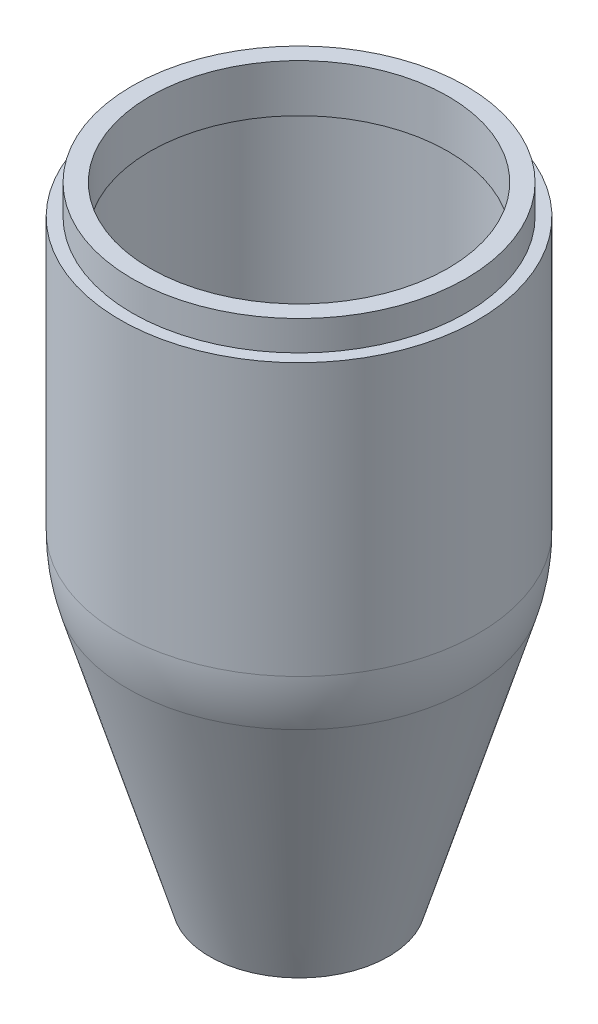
ISO-10303-21;
HEADER;
FILE_DESCRIPTION(('STEP AP214'),'2;1');
FILE_NAME('part.step','',(''),(''),'','','');
FILE_SCHEMA(('AUTOMOTIVE_DESIGN { 1 0 10303 214 1 1 1 1 }'));
ENDSEC;
DATA;
#1=APPLICATION_CONTEXT('core data for automotive mechanical design processes');
#2=APPLICATION_PROTOCOL_DEFINITION('international standard','automotive_design',2000,#1);
#3=PRODUCT_CONTEXT('',#1,'mechanical');
#4=PRODUCT('Part','Part','',(#3));
#5=PRODUCT_RELATED_PRODUCT_CATEGORY('part','',(#4));
#6=PRODUCT_DEFINITION_FORMATION('','',#4);
#7=PRODUCT_DEFINITION_CONTEXT('part definition',#1,'design');
#8=PRODUCT_DEFINITION('design','',#6,#7);
#9=PRODUCT_DEFINITION_SHAPE('','',#8);
#10=(LENGTH_UNIT() NAMED_UNIT(*) SI_UNIT(.MILLI.,.METRE.));
#11=(NAMED_UNIT(*) PLANE_ANGLE_UNIT() SI_UNIT($,.RADIAN.));
#12=(NAMED_UNIT(*) SI_UNIT($,.STERADIAN.) SOLID_ANGLE_UNIT());
#13=UNCERTAINTY_MEASURE_WITH_UNIT(LENGTH_MEASURE(1.E-05),#10,'distance_accuracy_value','');
#14=(GEOMETRIC_REPRESENTATION_CONTEXT(3) GLOBAL_UNCERTAINTY_ASSIGNED_CONTEXT((#13)) GLOBAL_UNIT_ASSIGNED_CONTEXT((#10,
#11,#12)) REPRESENTATION_CONTEXT('',''));
#15=CARTESIAN_POINT('',(0.,0.,0.));
#16=DIRECTION('',(0.,0.,1.));
#17=DIRECTION('',(1.,0.,0.));
#18=AXIS2_PLACEMENT_3D('',#15,#16,#17);
#19=CARTESIAN_POINT('',(0.,100.,0.));
#20=DIRECTION('',(0.,1.,0.));
#21=DIRECTION('',(0.,0.,1.));
#22=AXIS2_PLACEMENT_3D('',#19,#20,#21);
#23=PLANE('',#22);
#24=CARTESIAN_POINT('',(0.,100.,0.));
#25=DIRECTION('',(0.,-1.,0.));
#26=DIRECTION('',(0.,0.,-1.));
#27=AXIS2_PLACEMENT_3D('',#24,#25,#26);
#28=CIRCLE('',#27,30.);
#29=CARTESIAN_POINT('',(0.,100.,-30.));
#30=VERTEX_POINT('',#29);
#31=EDGE_CURVE('E11',#30,#30,#28,.T.);
#32=ORIENTED_EDGE('',*,*,#31,.F.);
#33=EDGE_LOOP('',(#32));
#34=FACE_BOUND('',#33,.T.);
#35=CARTESIAN_POINT('',(0.,100.,0.));
#36=DIRECTION('',(0.,1.,0.));
#37=DIRECTION('',(0.,0.,1.));
#38=AXIS2_PLACEMENT_3D('',#35,#36,#37);
#39=CIRCLE('',#38,28.);
#40=CARTESIAN_POINT('',(0.,100.,28.));
#41=VERTEX_POINT('',#40);
#42=EDGE_CURVE('E55',#41,#41,#39,.T.);
#43=ORIENTED_EDGE('',*,*,#42,.F.);
#44=EDGE_LOOP('',(#43));
#45=FACE_BOUND('',#44,.T.);
#46=ADVANCED_FACE('F34',(#34,#45),#23,.T.);
#47=CARTESIAN_POINT('',(15.,0.,0.));
#48=DIRECTION('',(0.,-1.,0.));
#49=DIRECTION('',(0.,0.,-1.));
#50=AXIS2_PLACEMENT_3D('',#47,#48,#49);
#51=PLANE('',#50);
#52=CARTESIAN_POINT('',(0.,0.,0.));
#53=DIRECTION('',(0.,-1.,0.));
#54=DIRECTION('',(0.,0.,-1.));
#55=AXIS2_PLACEMENT_3D('',#52,#53,#54);
#56=CIRCLE('',#55,11.8679080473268);
#57=CARTESIAN_POINT('',(0.,0.,-11.8679080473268));
#58=VERTEX_POINT('',#57);
#59=EDGE_CURVE('E64',#58,#58,#56,.T.);
#60=ORIENTED_EDGE('',*,*,#59,.F.);
#61=EDGE_LOOP('',(#60));
#62=FACE_BOUND('',#61,.T.);
#63=CARTESIAN_POINT('',(0.,0.,0.));
#64=DIRECTION('',(0.,-1.,0.));
#65=DIRECTION('',(0.,0.,-1.));
#66=AXIS2_PLACEMENT_3D('',#63,#64,#65);
#67=CIRCLE('',#66,15.);
#68=CARTESIAN_POINT('',(0.,0.,-15.));
#69=VERTEX_POINT('',#68);
#70=EDGE_CURVE('E49',#69,#69,#67,.T.);
#71=ORIENTED_EDGE('',*,*,#70,.T.);
#72=EDGE_LOOP('',(#71));
#73=FACE_BOUND('',#72,.T.);
#74=ADVANCED_FACE('F36',(#62,#73),#51,.T.);
#75=CARTESIAN_POINT('',(0.,0.,0.));
#76=DIRECTION('',(0.,-1.,0.));
#77=DIRECTION('',(0.,0.,-1.));
#78=AXIS2_PLACEMENT_3D('',#75,#76,#77);
#79=CYLINDRICAL_SURFACE('',#78,30.);
#80=ORIENTED_EDGE('',*,*,#31,.T.);
#81=EDGE_LOOP('',(#80));
#82=FACE_BOUND('',#81,.T.);
#83=CARTESIAN_POINT('',(0.,54.4030650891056,0.));
#84=DIRECTION('',(0.,-1.,0.));
#85=DIRECTION('',(0.,0.,-1.));
#86=AXIS2_PLACEMENT_3D('',#83,#84,#85);
#87=CIRCLE('',#86,30.);
#88=CARTESIAN_POINT('',(0.,54.4030650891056,-30.));
#89=VERTEX_POINT('',#88);
#90=EDGE_CURVE('E41',#89,#89,#87,.T.);
#91=ORIENTED_EDGE('',*,*,#90,.F.);
#92=EDGE_LOOP('',(#91));
#93=FACE_BOUND('',#92,.T.);
#94=ADVANCED_FACE('F102',(#82,#93),#79,.T.);
#95=CARTESIAN_POINT('',(0.,54.4030650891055,0.));
#96=DIRECTION('',(0.,-1.,0.));
#97=DIRECTION('',(1.,0.,0.));
#98=AXIS2_PLACEMENT_3D('',#95,#96,#97);
#99=SPHERICAL_SURFACE('',#98,30.);
#100=ORIENTED_EDGE('',*,*,#90,.T.);
#101=EDGE_LOOP('',(#100));
#102=FACE_BOUND('',#101,.T.);
#103=CARTESIAN_POINT('',(0.,45.782628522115,0.));
#104=DIRECTION('',(0.,-1.,0.));
#105=DIRECTION('',(0.,0.,-1.));
#106=AXIS2_PLACEMENT_3D('',#103,#104,#105);
#107=CIRCLE('',#106,28.7347885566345);
#108=CARTESIAN_POINT('',(0.,45.782628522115,-28.7347885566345));
#109=VERTEX_POINT('',#108);
#110=EDGE_CURVE('E45',#109,#109,#107,.T.);
#111=ORIENTED_EDGE('',*,*,#110,.F.);
#112=EDGE_LOOP('',(#111));
#113=FACE_BOUND('',#112,.T.);
#114=ADVANCED_FACE('F108',(#102,#113),#99,.T.);
#115=CARTESIAN_POINT('',(0.,0.,0.));
#116=DIRECTION('',(0.,1.,0.));
#117=DIRECTION('',(0.,0.,1.));
#118=AXIS2_PLACEMENT_3D('',#115,#116,#117);
#119=CONICAL_SURFACE('',#118,15.,0.291456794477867);
#120=ORIENTED_EDGE('',*,*,#110,.T.);
#121=EDGE_LOOP('',(#120));
#122=FACE_BOUND('',#121,.T.);
#123=ORIENTED_EDGE('',*,*,#70,.F.);
#124=EDGE_LOOP('',(#123));
#125=FACE_BOUND('',#124,.T.);
#126=ADVANCED_FACE('F105',(#122,#125),#119,.T.);
#127=CARTESIAN_POINT('',(0.,105.,0.));
#128=DIRECTION('',(0.,1.,0.));
#129=DIRECTION('',(0.,0.,1.));
#130=AXIS2_PLACEMENT_3D('',#127,#128,#129);
#131=PLANE('',#130);
#132=CARTESIAN_POINT('',(0.,105.,0.));
#133=DIRECTION('',(0.,1.,0.));
#134=DIRECTION('',(0.,0.,1.));
#135=AXIS2_PLACEMENT_3D('',#132,#133,#134);
#136=CIRCLE('',#135,28.);
#137=CARTESIAN_POINT('',(0.,105.,28.));
#138=VERTEX_POINT('',#137);
#139=EDGE_CURVE('E54',#138,#138,#136,.T.);
#140=ORIENTED_EDGE('',*,*,#139,.T.);
#141=EDGE_LOOP('',(#140));
#142=FACE_BOUND('',#141,.T.);
#143=CARTESIAN_POINT('',(0.,105.,0.));
#144=DIRECTION('',(0.,1.,0.));
#145=DIRECTION('',(1.,0.,0.));
#146=AXIS2_PLACEMENT_3D('',#143,#144,#145);
#147=CIRCLE('',#146,25.);
#148=CARTESIAN_POINT('',(25.,105.,0.));
#149=VERTEX_POINT('',#148);
#150=EDGE_CURVE('E58',#149,#149,#147,.T.);
#151=ORIENTED_EDGE('',*,*,#150,.F.);
#152=EDGE_LOOP('',(#151));
#153=FACE_BOUND('',#152,.T.);
#154=ADVANCED_FACE('F107',(#142,#153),#131,.T.);
#155=CARTESIAN_POINT('',(0.,105.,0.));
#156=DIRECTION('',(0.,-1.,0.));
#157=DIRECTION('',(0.,0.,-1.));
#158=AXIS2_PLACEMENT_3D('',#155,#156,#157);
#159=CYLINDRICAL_SURFACE('',#158,28.);
#160=ORIENTED_EDGE('',*,*,#139,.F.);
#161=EDGE_LOOP('',(#160));
#162=FACE_BOUND('',#161,.T.);
#163=ORIENTED_EDGE('',*,*,#42,.T.);
#164=EDGE_LOOP('',(#163));
#165=FACE_BOUND('',#164,.T.);
#166=ADVANCED_FACE('F115',(#162,#165),#159,.T.);
#167=CARTESIAN_POINT('',(0.,105.,0.));
#168=DIRECTION('',(0.,-1.,0.));
#169=DIRECTION('',(0.,0.,-1.));
#170=AXIS2_PLACEMENT_3D('',#167,#168,#169);
#171=CYLINDRICAL_SURFACE('',#170,25.);
#172=ORIENTED_EDGE('',*,*,#150,.T.);
#173=EDGE_LOOP('',(#172));
#174=FACE_BOUND('',#173,.T.);
#175=CARTESIAN_POINT('',(0.,97.,0.));
#176=DIRECTION('',(0.,1.,0.));
#177=DIRECTION('',(0.,0.,1.));
#178=AXIS2_PLACEMENT_3D('',#175,#176,#177);
#179=CIRCLE('',#178,25.);
#180=CARTESIAN_POINT('',(0.,97.,25.));
#181=VERTEX_POINT('',#180);
#182=EDGE_CURVE('E68',#181,#181,#179,.T.);
#183=ORIENTED_EDGE('',*,*,#182,.F.);
#184=EDGE_LOOP('',(#183));
#185=FACE_BOUND('',#184,.T.);
#186=ADVANCED_FACE('F158',(#174,#185),#171,.F.);
#187=CARTESIAN_POINT('',(0.,97.,0.));
#188=DIRECTION('',(0.,1.,0.));
#189=DIRECTION('',(0.,0.,1.));
#190=AXIS2_PLACEMENT_3D('',#187,#188,#189);
#191=PLANE('',#190);
#192=CARTESIAN_POINT('',(0.,97.,0.));
#193=DIRECTION('',(0.,1.,0.));
#194=DIRECTION('',(0.,0.,1.));
#195=AXIS2_PLACEMENT_3D('',#192,#193,#194);
#196=CIRCLE('',#195,27.);
#197=CARTESIAN_POINT('',(0.,97.,27.));
#198=VERTEX_POINT('',#197);
#199=EDGE_CURVE('E63',#198,#198,#196,.F.);
#200=ORIENTED_EDGE('',*,*,#199,.T.);
#201=EDGE_LOOP('',(#200));
#202=FACE_BOUND('',#201,.T.);
#203=ORIENTED_EDGE('',*,*,#182,.T.);
#204=EDGE_LOOP('',(#203));
#205=FACE_BOUND('',#204,.T.);
#206=ADVANCED_FACE('F79',(#202,#205),#191,.F.);
#207=CARTESIAN_POINT('',(0.,0.,0.));
#208=DIRECTION('',(0.,-1.,0.));
#209=DIRECTION('',(0.,0.,-1.));
#210=AXIS2_PLACEMENT_3D('',#207,#208,#209);
#211=CYLINDRICAL_SURFACE('',#210,27.);
#212=ORIENTED_EDGE('',*,*,#199,.F.);
#213=EDGE_LOOP('',(#212));
#214=FACE_BOUND('',#213,.T.);
#215=CARTESIAN_POINT('',(0.,54.4030650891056,0.));
#216=DIRECTION('',(0.,-1.,0.));
#217=DIRECTION('',(0.,0.,-1.));
#218=AXIS2_PLACEMENT_3D('',#215,#216,#217);
#219=CIRCLE('',#218,27.);
#220=CARTESIAN_POINT('',(0.,54.4030650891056,-27.));
#221=VERTEX_POINT('',#220);
#222=EDGE_CURVE('E71',#221,#221,#219,.T.);
#223=ORIENTED_EDGE('',*,*,#222,.T.);
#224=EDGE_LOOP('',(#223));
#225=FACE_BOUND('',#224,.T.);
#226=ADVANCED_FACE('F82',(#214,#225),#211,.F.);
#227=CARTESIAN_POINT('',(0.,54.4030650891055,0.));
#228=DIRECTION('',(0.,-1.,0.));
#229=DIRECTION('',(1.,0.,0.));
#230=AXIS2_PLACEMENT_3D('',#227,#228,#229);
#231=SPHERICAL_SURFACE('',#230,27.);
#232=ORIENTED_EDGE('',*,*,#222,.F.);
#233=EDGE_LOOP('',(#232));
#234=FACE_BOUND('',#233,.T.);
#235=CARTESIAN_POINT('',(0.,46.6446721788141,0.));
#236=DIRECTION('',(0.,1.,0.));
#237=DIRECTION('',(0.,0.,1.));
#238=AXIS2_PLACEMENT_3D('',#235,#236,#237);
#239=CIRCLE('',#238,25.8613097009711);
#240=CARTESIAN_POINT('',(0.,46.6446721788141,25.8613097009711));
#241=VERTEX_POINT('',#240);
#242=EDGE_CURVE('E67',#241,#241,#239,.F.);
#243=ORIENTED_EDGE('',*,*,#242,.T.);
#244=EDGE_LOOP('',(#243));
#245=FACE_BOUND('',#244,.T.);
#246=ADVANCED_FACE('F85',(#234,#245),#231,.F.);
#247=CARTESIAN_POINT('',(0.,0.862043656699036,0.));
#248=DIRECTION('',(0.,1.,0.));
#249=DIRECTION('',(0.,0.,1.));
#250=AXIS2_PLACEMENT_3D('',#247,#248,#249);
#251=CONICAL_SURFACE('',#250,12.1265211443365,0.291456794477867);
#252=ORIENTED_EDGE('',*,*,#242,.F.);
#253=EDGE_LOOP('',(#252));
#254=FACE_BOUND('',#253,.T.);
#255=ORIENTED_EDGE('',*,*,#59,.T.);
#256=EDGE_LOOP('',(#255));
#257=FACE_BOUND('',#256,.T.);
#258=ADVANCED_FACE('F91',(#254,#257),#251,.F.);
#259=CLOSED_SHELL('',(#46,#74,#94,#114,#126,#154,#166,#186,#206,#226,#246,#258));
#260=MANIFOLD_SOLID_BREP('B2',#259);
#261=ADVANCED_BREP_SHAPE_REPRESENTATION('',(#18,#260),#14);
#262=SHAPE_DEFINITION_REPRESENTATION(#9,#261);
ENDSEC;
END-ISO-10303-21;
